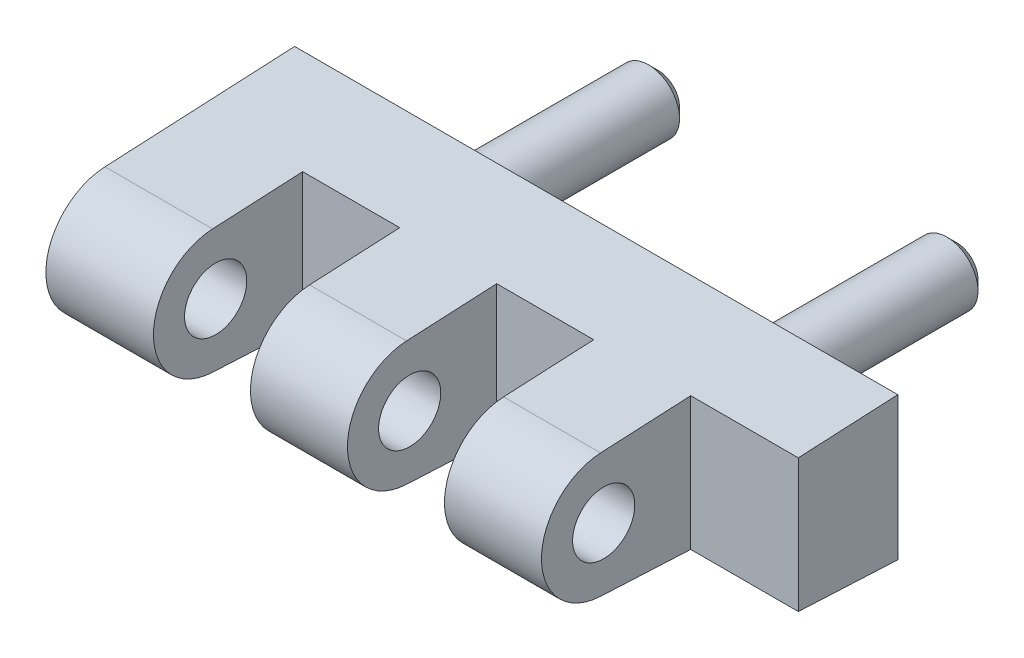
ISO-10303-21;
HEADER;
FILE_DESCRIPTION(('STEP AP214'),'2;1');
FILE_NAME('part.step','',(''),(''),'','','');
FILE_SCHEMA(('AUTOMOTIVE_DESIGN { 1 0 10303 214 1 1 1 1 }'));
ENDSEC;
DATA;
#1=APPLICATION_CONTEXT('core data for automotive mechanical design processes');
#2=APPLICATION_PROTOCOL_DEFINITION('international standard','automotive_design',2000,#1);
#3=PRODUCT_CONTEXT('',#1,'mechanical');
#4=PRODUCT('Part','Part','',(#3));
#5=PRODUCT_RELATED_PRODUCT_CATEGORY('part','',(#4));
#6=PRODUCT_DEFINITION_FORMATION('','',#4);
#7=PRODUCT_DEFINITION_CONTEXT('part definition',#1,'design');
#8=PRODUCT_DEFINITION('design','',#6,#7);
#9=PRODUCT_DEFINITION_SHAPE('','',#8);
#10=(LENGTH_UNIT() NAMED_UNIT(*) SI_UNIT(.MILLI.,.METRE.));
#11=(NAMED_UNIT(*) PLANE_ANGLE_UNIT() SI_UNIT($,.RADIAN.));
#12=(NAMED_UNIT(*) SI_UNIT($,.STERADIAN.) SOLID_ANGLE_UNIT());
#13=UNCERTAINTY_MEASURE_WITH_UNIT(LENGTH_MEASURE(1.E-05),#10,'distance_accuracy_value','');
#14=(GEOMETRIC_REPRESENTATION_CONTEXT(3) GLOBAL_UNCERTAINTY_ASSIGNED_CONTEXT((#13)) GLOBAL_UNIT_ASSIGNED_CONTEXT((#10,
#11,#12)) REPRESENTATION_CONTEXT('',''));
#15=CARTESIAN_POINT('',(0.,0.,0.));
#16=DIRECTION('',(0.,0.,1.));
#17=DIRECTION('',(1.,0.,0.));
#18=AXIS2_PLACEMENT_3D('',#15,#16,#17);
#19=CARTESIAN_POINT('',(36.25,0.,15.));
#20=DIRECTION('',(-1.,0.,0.));
#21=DIRECTION('',(0.,0.,1.));
#22=AXIS2_PLACEMENT_3D('',#19,#20,#21);
#23=CYLINDRICAL_SURFACE('',#22,5.);
#24=DIRECTION('',(-1.,0.,0.));
#25=VECTOR('',#24,1.);
#26=CARTESIAN_POINT('',(36.25,-4.99386330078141,15.2476475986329));
#27=LINE('',#26,#25);
#28=CARTESIAN_POINT('',(-3.6,-4.99386330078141,15.2476475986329));
#29=VERTEX_POINT('',#28);
#30=CARTESIAN_POINT('',(-12.25,-4.99386330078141,15.2476475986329));
#31=VERTEX_POINT('',#30);
#32=EDGE_CURVE('E162',#29,#31,#27,.T.);
#33=ORIENTED_EDGE('',*,*,#32,.F.);
#34=CARTESIAN_POINT('',(-3.6,0.,15.));
#35=DIRECTION('',(-1.,0.,0.));
#36=DIRECTION('',(0.,0.,1.));
#37=AXIS2_PLACEMENT_3D('',#34,#35,#36);
#38=CIRCLE('',#37,5.);
#39=CARTESIAN_POINT('',(-3.6,4.99386330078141,15.2476475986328));
#40=VERTEX_POINT('',#39);
#41=EDGE_CURVE('E205',#29,#40,#38,.T.);
#42=ORIENTED_EDGE('',*,*,#41,.T.);
#43=DIRECTION('',(-1.,0.,0.));
#44=VECTOR('',#43,1.);
#45=CARTESIAN_POINT('',(36.25,4.9938633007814,15.2476475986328));
#46=LINE('',#45,#44);
#47=CARTESIAN_POINT('',(-12.25,4.9938633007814,15.2476475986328));
#48=VERTEX_POINT('',#47);
#49=EDGE_CURVE('E175',#40,#48,#46,.T.);
#50=ORIENTED_EDGE('',*,*,#49,.T.);
#51=CARTESIAN_POINT('',(-12.25,0.,15.));
#52=DIRECTION('',(1.,0.,0.));
#53=DIRECTION('',(0.,0.,-1.));
#54=AXIS2_PLACEMENT_3D('',#51,#52,#53);
#55=CIRCLE('',#54,5.);
#56=EDGE_CURVE('E157',#48,#31,#55,.T.);
#57=ORIENTED_EDGE('',*,*,#56,.T.);
#58=EDGE_LOOP('',(#33,#42,#50,#57));
#59=FACE_BOUND('',#58,.T.);
#60=ADVANCED_FACE('F14',(#59),#23,.T.);
#61=CARTESIAN_POINT('',(12.,4.99386330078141,15.2476475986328));
#62=VERTEX_POINT('',#61);
#63=CARTESIAN_POINT('',(4.2,4.99386330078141,15.2476475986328));
#64=VERTEX_POINT('',#63);
#65=EDGE_CURVE('E177',#62,#64,#46,.T.);
#66=ORIENTED_EDGE('',*,*,#65,.T.);
#67=CARTESIAN_POINT('',(4.2,0.,15.));
#68=DIRECTION('',(1.,0.,0.));
#69=DIRECTION('',(0.,0.,-1.));
#70=AXIS2_PLACEMENT_3D('',#67,#68,#69);
#71=CIRCLE('',#70,5.);
#72=CARTESIAN_POINT('',(4.2,-4.99386330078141,15.2476475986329));
#73=VERTEX_POINT('',#72);
#74=EDGE_CURVE('E200',#64,#73,#71,.T.);
#75=ORIENTED_EDGE('',*,*,#74,.T.);
#76=CARTESIAN_POINT('',(12.,-4.99386330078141,15.2476475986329));
#77=VERTEX_POINT('',#76);
#78=EDGE_CURVE('E173',#77,#73,#27,.T.);
#79=ORIENTED_EDGE('',*,*,#78,.F.);
#80=CARTESIAN_POINT('',(12.,0.,15.));
#81=DIRECTION('',(-1.,0.,0.));
#82=DIRECTION('',(0.,0.,1.));
#83=AXIS2_PLACEMENT_3D('',#80,#81,#82);
#84=CIRCLE('',#83,5.);
#85=EDGE_CURVE('E195',#77,#62,#84,.T.);
#86=ORIENTED_EDGE('',*,*,#85,.T.);
#87=EDGE_LOOP('',(#66,#75,#79,#86));
#88=FACE_BOUND('',#87,.T.);
#89=ADVANCED_FACE('F234',(#88),#23,.T.);
#90=CARTESIAN_POINT('',(36.25,0.,15.));
#91=DIRECTION('',(-1.,0.,0.));
#92=DIRECTION('',(0.,0.,1.));
#93=AXIS2_PLACEMENT_3D('',#90,#91,#92);
#94=CYLINDRICAL_SURFACE('',#93,2.5);
#95=CARTESIAN_POINT('',(-3.6,0.,15.));
#96=DIRECTION('',(-1.,0.,0.));
#97=DIRECTION('',(0.,0.,1.));
#98=AXIS2_PLACEMENT_3D('',#95,#96,#97);
#99=CIRCLE('',#98,2.5);
#100=CARTESIAN_POINT('',(-3.6,0.,17.5));
#101=VERTEX_POINT('',#100);
#102=EDGE_CURVE('E202',#101,#101,#99,.T.);
#103=ORIENTED_EDGE('',*,*,#102,.F.);
#104=EDGE_LOOP('',(#103));
#105=FACE_BOUND('',#104,.T.);
#106=CARTESIAN_POINT('',(-12.25,0.,15.));
#107=DIRECTION('',(1.,0.,0.));
#108=DIRECTION('',(0.,0.,-1.));
#109=AXIS2_PLACEMENT_3D('',#106,#107,#108);
#110=CIRCLE('',#109,2.5);
#111=CARTESIAN_POINT('',(-12.25,0.,12.5));
#112=VERTEX_POINT('',#111);
#113=EDGE_CURVE('E150',#112,#112,#110,.T.);
#114=ORIENTED_EDGE('',*,*,#113,.F.);
#115=EDGE_LOOP('',(#114));
#116=FACE_BOUND('',#115,.T.);
#117=ADVANCED_FACE('F242',(#105,#116),#94,.F.);
#118=CARTESIAN_POINT('',(36.25,0.,15.));
#119=DIRECTION('',(1.,0.,0.));
#120=DIRECTION('',(0.,0.,-1.));
#121=AXIS2_PLACEMENT_3D('',#118,#119,#120);
#122=PLANE('',#121);
#123=DIRECTION('',(0.,1.,0.));
#124=VECTOR('',#123,1.);
#125=CARTESIAN_POINT('',(36.25,0.,8.));
#126=LINE('',#125,#124);
#127=CARTESIAN_POINT('',(36.25,-5.35327692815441,8.));
#128=VERTEX_POINT('',#127);
#129=CARTESIAN_POINT('',(36.25,5.3532769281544,8.));
#130=VERTEX_POINT('',#129);
#131=EDGE_CURVE('E140',#128,#130,#126,.T.);
#132=ORIENTED_EDGE('',*,*,#131,.F.);
#133=DIRECTION('',(0.,-0.0495295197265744,-0.998772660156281));
#134=VECTOR('',#133,1.);
#135=CARTESIAN_POINT('',(36.25,-5.75,0.));
#136=LINE('',#135,#134);
#137=CARTESIAN_POINT('',(36.25,-5.75,0.));
#138=VERTEX_POINT('',#137);
#139=EDGE_CURVE('E138',#128,#138,#136,.T.);
#140=ORIENTED_EDGE('',*,*,#139,.T.);
#141=DIRECTION('',(0.,1.,0.));
#142=VECTOR('',#141,1.);
#143=CARTESIAN_POINT('',(36.25,5.75,0.));
#144=LINE('',#143,#142);
#145=CARTESIAN_POINT('',(36.25,5.75,0.));
#146=VERTEX_POINT('',#145);
#147=EDGE_CURVE('E156',#138,#146,#144,.T.);
#148=ORIENTED_EDGE('',*,*,#147,.T.);
#149=DIRECTION('',(0.,-0.0495295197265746,0.998772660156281));
#150=VECTOR('',#149,1.);
#151=CARTESIAN_POINT('',(36.25,5.75,0.));
#152=LINE('',#151,#150);
#153=EDGE_CURVE('E159',#146,#130,#152,.T.);
#154=ORIENTED_EDGE('',*,*,#153,.T.);
#155=EDGE_LOOP('',(#132,#140,#148,#154));
#156=FACE_BOUND('',#155,.T.);
#157=ADVANCED_FACE('F342',(#156),#122,.T.);
#158=CARTESIAN_POINT('',(-12.25,0.,15.));
#159=DIRECTION('',(1.,0.,0.));
#160=DIRECTION('',(0.,0.,-1.));
#161=AXIS2_PLACEMENT_3D('',#158,#159,#160);
#162=PLANE('',#161);
#163=DIRECTION('',(0.,-0.0495295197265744,-0.998772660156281));
#164=VECTOR('',#163,1.);
#165=CARTESIAN_POINT('',(-12.25,-5.75,0.));
#166=LINE('',#165,#164);
#167=CARTESIAN_POINT('',(-12.25,-5.75,0.));
#168=VERTEX_POINT('',#167);
#169=EDGE_CURVE('E154',#31,#168,#166,.T.);
#170=ORIENTED_EDGE('',*,*,#169,.F.);
#171=ORIENTED_EDGE('',*,*,#56,.F.);
#172=DIRECTION('',(0.,-0.0495295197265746,0.998772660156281));
#173=VECTOR('',#172,1.);
#174=CARTESIAN_POINT('',(-12.25,5.75,0.));
#175=LINE('',#174,#173);
#176=CARTESIAN_POINT('',(-12.25,5.75,0.));
#177=VERTEX_POINT('',#176);
#178=EDGE_CURVE('E167',#177,#48,#175,.T.);
#179=ORIENTED_EDGE('',*,*,#178,.F.);
#180=DIRECTION('',(0.,1.,0.));
#181=VECTOR('',#180,1.);
#182=CARTESIAN_POINT('',(-12.25,5.75,0.));
#183=LINE('',#182,#181);
#184=EDGE_CURVE('E165',#168,#177,#183,.T.);
#185=ORIENTED_EDGE('',*,*,#184,.F.);
#186=EDGE_LOOP('',(#170,#171,#179,#185));
#187=FACE_BOUND('',#186,.T.);
#188=ORIENTED_EDGE('',*,*,#113,.T.);
#189=EDGE_LOOP('',(#188));
#190=FACE_BOUND('',#189,.T.);
#191=ADVANCED_FACE('F344',(#187,#190),#162,.F.);
#192=CARTESIAN_POINT('',(36.25,-5.75,0.));
#193=DIRECTION('',(0.,0.998772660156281,-0.0495295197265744));
#194=DIRECTION('',(0.,0.0495295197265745,0.998772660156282));
#195=AXIS2_PLACEMENT_3D('',#192,#193,#194);
#196=PLANE('',#195);
#197=DIRECTION('',(-1.,0.,0.));
#198=VECTOR('',#197,1.);
#199=CARTESIAN_POINT('',(36.25,-5.35327692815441,8.));
#200=LINE('',#199,#198);
#201=CARTESIAN_POINT('',(4.2,-5.35327692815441,8.));
#202=VERTEX_POINT('',#201);
#203=CARTESIAN_POINT('',(-3.6,-5.35327692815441,8.));
#204=VERTEX_POINT('',#203);
#205=EDGE_CURVE('E145',#202,#204,#200,.T.);
#206=ORIENTED_EDGE('',*,*,#205,.T.);
#207=DIRECTION('',(0.,0.0495295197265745,0.998772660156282));
#208=VECTOR('',#207,1.);
#209=CARTESIAN_POINT('',(-3.6,-5.75,0.));
#210=LINE('',#209,#208);
#211=EDGE_CURVE('E284',#204,#29,#210,.T.);
#212=ORIENTED_EDGE('',*,*,#211,.T.);
#213=ORIENTED_EDGE('',*,*,#32,.T.);
#214=ORIENTED_EDGE('',*,*,#169,.T.);
#215=DIRECTION('',(-1.,0.,0.));
#216=VECTOR('',#215,1.);
#217=CARTESIAN_POINT('',(36.25,-5.75,0.));
#218=LINE('',#217,#216);
#219=EDGE_CURVE('E182',#138,#168,#218,.T.);
#220=ORIENTED_EDGE('',*,*,#219,.F.);
#221=ORIENTED_EDGE('',*,*,#139,.F.);
#222=DIRECTION('',(-1.,0.,0.));
#223=VECTOR('',#222,1.);
#224=CARTESIAN_POINT('',(36.25,-5.35327692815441,8.));
#225=LINE('',#224,#223);
#226=CARTESIAN_POINT('',(27.6,-5.35327692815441,8.));
#227=VERTEX_POINT('',#226);
#228=EDGE_CURVE('E128',#128,#227,#225,.T.);
#229=ORIENTED_EDGE('',*,*,#228,.T.);
#230=DIRECTION('',(0.,0.0495295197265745,0.998772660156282));
#231=VECTOR('',#230,1.);
#232=CARTESIAN_POINT('',(27.6,-5.75,0.));
#233=LINE('',#232,#231);
#234=CARTESIAN_POINT('',(27.6,-4.99386330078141,15.2476475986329));
#235=VERTEX_POINT('',#234);
#236=EDGE_CURVE('E115',#227,#235,#233,.T.);
#237=ORIENTED_EDGE('',*,*,#236,.T.);
#238=CARTESIAN_POINT('',(19.8,-4.99386330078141,15.2476475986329));
#239=VERTEX_POINT('',#238);
#240=EDGE_CURVE('E174',#235,#239,#27,.T.);
#241=ORIENTED_EDGE('',*,*,#240,.T.);
#242=DIRECTION('',(0.,-0.0495295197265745,-0.998772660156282));
#243=VECTOR('',#242,1.);
#244=CARTESIAN_POINT('',(19.8,-5.75,0.));
#245=LINE('',#244,#243);
#246=CARTESIAN_POINT('',(19.8,-5.35327692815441,8.));
#247=VERTEX_POINT('',#246);
#248=EDGE_CURVE('E196',#239,#247,#245,.T.);
#249=ORIENTED_EDGE('',*,*,#248,.T.);
#250=DIRECTION('',(-1.,0.,0.));
#251=VECTOR('',#250,1.);
#252=CARTESIAN_POINT('',(36.25,-5.35327692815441,8.));
#253=LINE('',#252,#251);
#254=CARTESIAN_POINT('',(12.,-5.35327692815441,8.));
#255=VERTEX_POINT('',#254);
#256=EDGE_CURVE('E287',#247,#255,#253,.T.);
#257=ORIENTED_EDGE('',*,*,#256,.T.);
#258=DIRECTION('',(0.,0.0495295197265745,0.998772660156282));
#259=VECTOR('',#258,1.);
#260=CARTESIAN_POINT('',(12.,-5.75,0.));
#261=LINE('',#260,#259);
#262=EDGE_CURVE('E201',#255,#77,#261,.T.);
#263=ORIENTED_EDGE('',*,*,#262,.T.);
#264=ORIENTED_EDGE('',*,*,#78,.T.);
#265=DIRECTION('',(0.,-0.0495295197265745,-0.998772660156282));
#266=VECTOR('',#265,1.);
#267=CARTESIAN_POINT('',(4.2,-5.75,0.));
#268=LINE('',#267,#266);
#269=EDGE_CURVE('E37',#73,#202,#268,.T.);
#270=ORIENTED_EDGE('',*,*,#269,.T.);
#271=EDGE_LOOP('',(#206,#212,#213,#214,#220,#221,#229,#237,#241,#249,#257,#263,#264,#270));
#272=FACE_BOUND('',#271,.T.);
#273=ADVANCED_FACE('F136',(#272),#196,.F.);
#274=CARTESIAN_POINT('',(36.25,5.75,0.));
#275=DIRECTION('',(0.,0.,1.));
#276=DIRECTION('',(0.,-1.,0.));
#277=AXIS2_PLACEMENT_3D('',#274,#275,#276);
#278=PLANE('',#277);
#279=CARTESIAN_POINT('',(0.,0.,0.));
#280=DIRECTION('',(0.,0.,-1.));
#281=DIRECTION('',(0.,1.,0.));
#282=AXIS2_PLACEMENT_3D('',#279,#280,#281);
#283=CIRCLE('',#282,2.5);
#284=CARTESIAN_POINT('',(0.,2.5,0.));
#285=VERTEX_POINT('',#284);
#286=EDGE_CURVE('E143',#285,#285,#283,.T.);
#287=ORIENTED_EDGE('',*,*,#286,.F.);
#288=EDGE_LOOP('',(#287));
#289=FACE_BOUND('',#288,.T.);
#290=CARTESIAN_POINT('',(24.,0.,0.));
#291=DIRECTION('',(0.,0.,-1.));
#292=DIRECTION('',(0.,1.,0.));
#293=AXIS2_PLACEMENT_3D('',#290,#291,#292);
#294=CIRCLE('',#293,2.5);
#295=CARTESIAN_POINT('',(24.,2.5,0.));
#296=VERTEX_POINT('',#295);
#297=EDGE_CURVE('E139',#296,#296,#294,.T.);
#298=ORIENTED_EDGE('',*,*,#297,.F.);
#299=EDGE_LOOP('',(#298));
#300=FACE_BOUND('',#299,.T.);
#301=ORIENTED_EDGE('',*,*,#184,.T.);
#302=DIRECTION('',(-1.,0.,0.));
#303=VECTOR('',#302,1.);
#304=CARTESIAN_POINT('',(36.25,5.75,0.));
#305=LINE('',#304,#303);
#306=EDGE_CURVE('E179',#146,#177,#305,.T.);
#307=ORIENTED_EDGE('',*,*,#306,.F.);
#308=ORIENTED_EDGE('',*,*,#147,.F.);
#309=ORIENTED_EDGE('',*,*,#219,.T.);
#310=EDGE_LOOP('',(#301,#307,#308,#309));
#311=FACE_BOUND('',#310,.T.);
#312=ADVANCED_FACE('F257',(#289,#300,#311),#278,.F.);
#313=CARTESIAN_POINT('',(36.25,5.75,0.));
#314=DIRECTION('',(0.,-0.998772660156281,-0.0495295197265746));
#315=DIRECTION('',(0.,0.0495295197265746,-0.998772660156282));
#316=AXIS2_PLACEMENT_3D('',#313,#314,#315);
#317=PLANE('',#316);
#318=ORIENTED_EDGE('',*,*,#49,.F.);
#319=DIRECTION('',(0.,0.0495295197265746,-0.998772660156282));
#320=VECTOR('',#319,1.);
#321=CARTESIAN_POINT('',(-3.6,5.75,0.));
#322=LINE('',#321,#320);
#323=CARTESIAN_POINT('',(-3.6,5.3532769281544,8.));
#324=VERTEX_POINT('',#323);
#325=EDGE_CURVE('E282',#40,#324,#322,.T.);
#326=ORIENTED_EDGE('',*,*,#325,.T.);
#327=DIRECTION('',(1.,0.,0.));
#328=VECTOR('',#327,1.);
#329=CARTESIAN_POINT('',(36.25,5.3532769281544,8.));
#330=LINE('',#329,#328);
#331=CARTESIAN_POINT('',(4.2,5.3532769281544,8.));
#332=VERTEX_POINT('',#331);
#333=EDGE_CURVE('E210',#324,#332,#330,.T.);
#334=ORIENTED_EDGE('',*,*,#333,.T.);
#335=DIRECTION('',(0.,-0.0495295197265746,0.998772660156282));
#336=VECTOR('',#335,1.);
#337=CARTESIAN_POINT('',(4.2,5.75,0.));
#338=LINE('',#337,#336);
#339=EDGE_CURVE('E272',#332,#64,#338,.T.);
#340=ORIENTED_EDGE('',*,*,#339,.T.);
#341=ORIENTED_EDGE('',*,*,#65,.F.);
#342=DIRECTION('',(0.,0.0495295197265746,-0.998772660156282));
#343=VECTOR('',#342,1.);
#344=CARTESIAN_POINT('',(12.,5.75,0.));
#345=LINE('',#344,#343);
#346=CARTESIAN_POINT('',(12.,5.3532769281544,8.));
#347=VERTEX_POINT('',#346);
#348=EDGE_CURVE('E271',#62,#347,#345,.T.);
#349=ORIENTED_EDGE('',*,*,#348,.T.);
#350=DIRECTION('',(1.,0.,0.));
#351=VECTOR('',#350,1.);
#352=CARTESIAN_POINT('',(36.25,5.3532769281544,8.));
#353=LINE('',#352,#351);
#354=CARTESIAN_POINT('',(19.8,5.3532769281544,8.));
#355=VERTEX_POINT('',#354);
#356=EDGE_CURVE('E207',#347,#355,#353,.T.);
#357=ORIENTED_EDGE('',*,*,#356,.T.);
#358=DIRECTION('',(0.,-0.0495295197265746,0.998772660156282));
#359=VECTOR('',#358,1.);
#360=CARTESIAN_POINT('',(19.8,5.75,0.));
#361=LINE('',#360,#359);
#362=CARTESIAN_POINT('',(19.8,4.99386330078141,15.2476475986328));
#363=VERTEX_POINT('',#362);
#364=EDGE_CURVE('E306',#355,#363,#361,.T.);
#365=ORIENTED_EDGE('',*,*,#364,.T.);
#366=CARTESIAN_POINT('',(27.6,4.9938633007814,15.2476475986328));
#367=VERTEX_POINT('',#366);
#368=EDGE_CURVE('E178',#367,#363,#46,.T.);
#369=ORIENTED_EDGE('',*,*,#368,.F.);
#370=DIRECTION('',(0.,0.0495295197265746,-0.998772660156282));
#371=VECTOR('',#370,1.);
#372=CARTESIAN_POINT('',(27.6,5.75,0.));
#373=LINE('',#372,#371);
#374=CARTESIAN_POINT('',(27.6,5.3532769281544,8.));
#375=VERTEX_POINT('',#374);
#376=EDGE_CURVE('E29',#367,#375,#373,.T.);
#377=ORIENTED_EDGE('',*,*,#376,.T.);
#378=DIRECTION('',(1.,0.,0.));
#379=VECTOR('',#378,1.);
#380=CARTESIAN_POINT('',(36.25,5.3532769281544,8.));
#381=LINE('',#380,#379);
#382=EDGE_CURVE('E131',#375,#130,#381,.T.);
#383=ORIENTED_EDGE('',*,*,#382,.T.);
#384=ORIENTED_EDGE('',*,*,#153,.F.);
#385=ORIENTED_EDGE('',*,*,#306,.T.);
#386=ORIENTED_EDGE('',*,*,#178,.T.);
#387=EDGE_LOOP('',(#318,#326,#334,#340,#341,#349,#357,#365,#369,#377,#383,#384,#385,#386));
#388=FACE_BOUND('',#387,.T.);
#389=ADVANCED_FACE('F248',(#388),#317,.F.);
#390=ORIENTED_EDGE('',*,*,#368,.T.);
#391=CARTESIAN_POINT('',(19.8,0.,15.));
#392=DIRECTION('',(1.,0.,0.));
#393=DIRECTION('',(0.,0.,-1.));
#394=AXIS2_PLACEMENT_3D('',#391,#392,#393);
#395=CIRCLE('',#394,5.);
#396=EDGE_CURVE('E191',#363,#239,#395,.T.);
#397=ORIENTED_EDGE('',*,*,#396,.T.);
#398=ORIENTED_EDGE('',*,*,#240,.F.);
#399=CARTESIAN_POINT('',(27.6,0.,15.));
#400=DIRECTION('',(-1.,0.,0.));
#401=DIRECTION('',(0.,0.,1.));
#402=AXIS2_PLACEMENT_3D('',#399,#400,#401);
#403=CIRCLE('',#402,5.);
#404=EDGE_CURVE('E119',#235,#367,#403,.T.);
#405=ORIENTED_EDGE('',*,*,#404,.T.);
#406=EDGE_LOOP('',(#390,#397,#398,#405));
#407=FACE_BOUND('',#406,.T.);
#408=ADVANCED_FACE('F237',(#407),#23,.T.);
#409=CARTESIAN_POINT('',(27.6,-8.25,26.1790008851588));
#410=DIRECTION('',(-1.,0.,0.));
#411=DIRECTION('',(0.,0.,1.));
#412=AXIS2_PLACEMENT_3D('',#409,#410,#411);
#413=PLANE('',#412);
#414=CARTESIAN_POINT('',(27.6,0.,15.));
#415=DIRECTION('',(-1.,0.,0.));
#416=DIRECTION('',(0.,0.,1.));
#417=AXIS2_PLACEMENT_3D('',#414,#415,#416);
#418=CIRCLE('',#417,2.5);
#419=CARTESIAN_POINT('',(27.6,0.,17.5));
#420=VERTEX_POINT('',#419);
#421=EDGE_CURVE('E185',#420,#420,#418,.T.);
#422=ORIENTED_EDGE('',*,*,#421,.T.);
#423=EDGE_LOOP('',(#422));
#424=FACE_BOUND('',#423,.T.);
#425=DIRECTION('',(0.,1.,0.));
#426=VECTOR('',#425,1.);
#427=CARTESIAN_POINT('',(27.6,-8.25,8.));
#428=LINE('',#427,#426);
#429=EDGE_CURVE('E118',#227,#375,#428,.T.);
#430=ORIENTED_EDGE('',*,*,#429,.T.);
#431=ORIENTED_EDGE('',*,*,#376,.F.);
#432=ORIENTED_EDGE('',*,*,#404,.F.);
#433=ORIENTED_EDGE('',*,*,#236,.F.);
#434=EDGE_LOOP('',(#430,#431,#432,#433));
#435=FACE_BOUND('',#434,.T.);
#436=ADVANCED_FACE('F117',(#424,#435),#413,.F.);
#437=CARTESIAN_POINT('',(27.6,-8.25,8.));
#438=DIRECTION('',(0.,0.,-1.));
#439=DIRECTION('',(-1.,0.,0.));
#440=AXIS2_PLACEMENT_3D('',#437,#438,#439);
#441=PLANE('',#440);
#442=ORIENTED_EDGE('',*,*,#131,.T.);
#443=ORIENTED_EDGE('',*,*,#382,.F.);
#444=ORIENTED_EDGE('',*,*,#429,.F.);
#445=ORIENTED_EDGE('',*,*,#228,.F.);
#446=EDGE_LOOP('',(#442,#443,#444,#445));
#447=FACE_BOUND('',#446,.T.);
#448=ADVANCED_FACE('F127',(#447),#441,.F.);
#449=CARTESIAN_POINT('',(12.,-8.25,8.));
#450=DIRECTION('',(-1.,0.,0.));
#451=DIRECTION('',(0.,0.,1.));
#452=AXIS2_PLACEMENT_3D('',#449,#450,#451);
#453=PLANE('',#452);
#454=CARTESIAN_POINT('',(12.,0.,15.));
#455=DIRECTION('',(-1.,0.,0.));
#456=DIRECTION('',(0.,0.,1.));
#457=AXIS2_PLACEMENT_3D('',#454,#455,#456);
#458=CIRCLE('',#457,2.5);
#459=CARTESIAN_POINT('',(12.,0.,17.5));
#460=VERTEX_POINT('',#459);
#461=EDGE_CURVE('E192',#460,#460,#458,.T.);
#462=ORIENTED_EDGE('',*,*,#461,.T.);
#463=EDGE_LOOP('',(#462));
#464=FACE_BOUND('',#463,.T.);
#465=DIRECTION('',(0.,1.,0.));
#466=VECTOR('',#465,1.);
#467=CARTESIAN_POINT('',(12.,-8.25,8.));
#468=LINE('',#467,#466);
#469=EDGE_CURVE('E295',#255,#347,#468,.T.);
#470=ORIENTED_EDGE('',*,*,#469,.T.);
#471=ORIENTED_EDGE('',*,*,#348,.F.);
#472=ORIENTED_EDGE('',*,*,#85,.F.);
#473=ORIENTED_EDGE('',*,*,#262,.F.);
#474=EDGE_LOOP('',(#470,#471,#472,#473));
#475=FACE_BOUND('',#474,.T.);
#476=ADVANCED_FACE('F319',(#464,#475),#453,.F.);
#477=CARTESIAN_POINT('',(19.8,-8.25,8.));
#478=DIRECTION('',(1.,0.,0.));
#479=DIRECTION('',(0.,0.,-1.));
#480=AXIS2_PLACEMENT_3D('',#477,#478,#479);
#481=PLANE('',#480);
#482=CARTESIAN_POINT('',(19.8,0.,15.));
#483=DIRECTION('',(1.,0.,0.));
#484=DIRECTION('',(0.,0.,-1.));
#485=AXIS2_PLACEMENT_3D('',#482,#483,#484);
#486=CIRCLE('',#485,2.5);
#487=CARTESIAN_POINT('',(19.8,0.,12.5));
#488=VERTEX_POINT('',#487);
#489=EDGE_CURVE('E124',#488,#488,#486,.T.);
#490=ORIENTED_EDGE('',*,*,#489,.T.);
#491=EDGE_LOOP('',(#490));
#492=FACE_BOUND('',#491,.T.);
#493=ORIENTED_EDGE('',*,*,#396,.F.);
#494=ORIENTED_EDGE('',*,*,#364,.F.);
#495=DIRECTION('',(0.,1.,0.));
#496=VECTOR('',#495,1.);
#497=CARTESIAN_POINT('',(19.8,-8.25,8.));
#498=LINE('',#497,#496);
#499=EDGE_CURVE('E132',#247,#355,#498,.T.);
#500=ORIENTED_EDGE('',*,*,#499,.F.);
#501=ORIENTED_EDGE('',*,*,#248,.F.);
#502=EDGE_LOOP('',(#493,#494,#500,#501));
#503=FACE_BOUND('',#502,.T.);
#504=ADVANCED_FACE('F316',(#492,#503),#481,.F.);
#505=CARTESIAN_POINT('',(12.,-8.25,8.));
#506=DIRECTION('',(0.,0.,-1.));
#507=DIRECTION('',(-1.,0.,0.));
#508=AXIS2_PLACEMENT_3D('',#505,#506,#507);
#509=PLANE('',#508);
#510=ORIENTED_EDGE('',*,*,#499,.T.);
#511=ORIENTED_EDGE('',*,*,#356,.F.);
#512=ORIENTED_EDGE('',*,*,#469,.F.);
#513=ORIENTED_EDGE('',*,*,#256,.F.);
#514=EDGE_LOOP('',(#510,#511,#512,#513));
#515=FACE_BOUND('',#514,.T.);
#516=ADVANCED_FACE('F318',(#515),#509,.F.);
#517=CARTESIAN_POINT('',(4.2,0.,15.));
#518=DIRECTION('',(1.,0.,0.));
#519=DIRECTION('',(0.,0.,-1.));
#520=AXIS2_PLACEMENT_3D('',#517,#518,#519);
#521=CIRCLE('',#520,2.5);
#522=CARTESIAN_POINT('',(4.2,0.,12.5));
#523=VERTEX_POINT('',#522);
#524=EDGE_CURVE('E197',#523,#523,#521,.T.);
#525=ORIENTED_EDGE('',*,*,#524,.F.);
#526=EDGE_LOOP('',(#525));
#527=FACE_BOUND('',#526,.T.);
#528=ORIENTED_EDGE('',*,*,#461,.F.);
#529=EDGE_LOOP('',(#528));
#530=FACE_BOUND('',#529,.T.);
#531=ADVANCED_FACE('F335',(#527,#530),#94,.F.);
#532=CARTESIAN_POINT('',(-3.6,-8.25,8.));
#533=DIRECTION('',(0.,0.,-1.));
#534=DIRECTION('',(-1.,0.,0.));
#535=AXIS2_PLACEMENT_3D('',#532,#533,#534);
#536=PLANE('',#535);
#537=DIRECTION('',(0.,1.,0.));
#538=VECTOR('',#537,1.);
#539=CARTESIAN_POINT('',(4.2,-8.25,8.));
#540=LINE('',#539,#538);
#541=EDGE_CURVE('E292',#202,#332,#540,.T.);
#542=ORIENTED_EDGE('',*,*,#541,.T.);
#543=ORIENTED_EDGE('',*,*,#333,.F.);
#544=DIRECTION('',(0.,1.,0.));
#545=VECTOR('',#544,1.);
#546=CARTESIAN_POINT('',(-3.6,-8.25,8.));
#547=LINE('',#546,#545);
#548=EDGE_CURVE('E188',#204,#324,#547,.T.);
#549=ORIENTED_EDGE('',*,*,#548,.F.);
#550=ORIENTED_EDGE('',*,*,#205,.F.);
#551=EDGE_LOOP('',(#542,#543,#549,#550));
#552=FACE_BOUND('',#551,.T.);
#553=ADVANCED_FACE('F291',(#552),#536,.F.);
#554=CARTESIAN_POINT('',(-3.6,-8.25,30.3209215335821));
#555=DIRECTION('',(-1.,0.,0.));
#556=DIRECTION('',(0.,0.,1.));
#557=AXIS2_PLACEMENT_3D('',#554,#555,#556);
#558=PLANE('',#557);
#559=ORIENTED_EDGE('',*,*,#102,.T.);
#560=EDGE_LOOP('',(#559));
#561=FACE_BOUND('',#560,.T.);
#562=ORIENTED_EDGE('',*,*,#548,.T.);
#563=ORIENTED_EDGE('',*,*,#325,.F.);
#564=ORIENTED_EDGE('',*,*,#41,.F.);
#565=ORIENTED_EDGE('',*,*,#211,.F.);
#566=EDGE_LOOP('',(#562,#563,#564,#565));
#567=FACE_BOUND('',#566,.T.);
#568=ADVANCED_FACE('F370',(#561,#567),#558,.F.);
#569=CARTESIAN_POINT('',(4.2,-8.25,26.1790008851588));
#570=DIRECTION('',(1.,0.,0.));
#571=DIRECTION('',(0.,0.,-1.));
#572=AXIS2_PLACEMENT_3D('',#569,#570,#571);
#573=PLANE('',#572);
#574=ORIENTED_EDGE('',*,*,#524,.T.);
#575=EDGE_LOOP('',(#574));
#576=FACE_BOUND('',#575,.T.);
#577=ORIENTED_EDGE('',*,*,#74,.F.);
#578=ORIENTED_EDGE('',*,*,#339,.F.);
#579=ORIENTED_EDGE('',*,*,#541,.F.);
#580=ORIENTED_EDGE('',*,*,#269,.F.);
#581=EDGE_LOOP('',(#577,#578,#579,#580));
#582=FACE_BOUND('',#581,.T.);
#583=ADVANCED_FACE('F294',(#576,#582),#573,.F.);
#584=ORIENTED_EDGE('',*,*,#489,.F.);
#585=EDGE_LOOP('',(#584));
#586=FACE_BOUND('',#585,.T.);
#587=ORIENTED_EDGE('',*,*,#421,.F.);
#588=EDGE_LOOP('',(#587));
#589=FACE_BOUND('',#588,.T.);
#590=ADVANCED_FACE('F337',(#586,#589),#94,.F.);
#591=CARTESIAN_POINT('',(24.,0.,-17.));
#592=DIRECTION('',(0.,0.,1.));
#593=DIRECTION('',(0.,-1.,0.));
#594=AXIS2_PLACEMENT_3D('',#591,#592,#593);
#595=CYLINDRICAL_SURFACE('',#594,2.5);
#596=CARTESIAN_POINT('',(24.,0.,-16.2));
#597=DIRECTION('',(0.,0.,-1.));
#598=DIRECTION('',(0.,1.,0.));
#599=AXIS2_PLACEMENT_3D('',#596,#597,#598);
#600=CIRCLE('',#599,2.5);
#601=CARTESIAN_POINT('',(24.,2.5,-16.2));
#602=VERTEX_POINT('',#601);
#603=EDGE_CURVE('E216',#602,#602,#600,.F.);
#604=ORIENTED_EDGE('',*,*,#603,.T.);
#605=EDGE_LOOP('',(#604));
#606=FACE_BOUND('',#605,.T.);
#607=ORIENTED_EDGE('',*,*,#297,.T.);
#608=EDGE_LOOP('',(#607));
#609=FACE_BOUND('',#608,.T.);
#610=ADVANCED_FACE('F340',(#606,#609),#595,.T.);
#611=CARTESIAN_POINT('',(24.,0.,-17.));
#612=DIRECTION('',(0.,0.,-1.));
#613=DIRECTION('',(0.,1.,0.));
#614=AXIS2_PLACEMENT_3D('',#611,#612,#613);
#615=PLANE('',#614);
#616=CARTESIAN_POINT('',(24.,0.,-17.));
#617=DIRECTION('',(0.,0.,-1.));
#618=DIRECTION('',(0.,1.,0.));
#619=AXIS2_PLACEMENT_3D('',#616,#617,#618);
#620=CIRCLE('',#619,1.7);
#621=CARTESIAN_POINT('',(24.,1.7,-17.));
#622=VERTEX_POINT('',#621);
#623=EDGE_CURVE('E213',#622,#622,#620,.T.);
#624=ORIENTED_EDGE('',*,*,#623,.T.);
#625=EDGE_LOOP('',(#624));
#626=FACE_BOUND('',#625,.T.);
#627=ADVANCED_FACE('F389',(#626),#615,.T.);
#628=CARTESIAN_POINT('',(0.,0.,-17.));
#629=DIRECTION('',(0.,0.,1.));
#630=DIRECTION('',(0.,-1.,0.));
#631=AXIS2_PLACEMENT_3D('',#628,#629,#630);
#632=CYLINDRICAL_SURFACE('',#631,2.5);
#633=CARTESIAN_POINT('',(0.,0.,-16.2));
#634=DIRECTION('',(0.,0.,-1.));
#635=DIRECTION('',(0.,1.,0.));
#636=AXIS2_PLACEMENT_3D('',#633,#634,#635);
#637=CIRCLE('',#636,2.5);
#638=CARTESIAN_POINT('',(0.,2.5,-16.2));
#639=VERTEX_POINT('',#638);
#640=EDGE_CURVE('E9',#639,#639,#637,.F.);
#641=ORIENTED_EDGE('',*,*,#640,.T.);
#642=EDGE_LOOP('',(#641));
#643=FACE_BOUND('',#642,.T.);
#644=ORIENTED_EDGE('',*,*,#286,.T.);
#645=EDGE_LOOP('',(#644));
#646=FACE_BOUND('',#645,.T.);
#647=ADVANCED_FACE('F393',(#643,#646),#632,.T.);
#648=CARTESIAN_POINT('',(0.,0.,-17.));
#649=DIRECTION('',(0.,0.,-1.));
#650=DIRECTION('',(0.,1.,0.));
#651=AXIS2_PLACEMENT_3D('',#648,#649,#650);
#652=PLANE('',#651);
#653=CARTESIAN_POINT('',(0.,0.,-17.));
#654=DIRECTION('',(0.,0.,-1.));
#655=DIRECTION('',(0.,1.,0.));
#656=AXIS2_PLACEMENT_3D('',#653,#654,#655);
#657=CIRCLE('',#656,1.7);
#658=CARTESIAN_POINT('',(0.,1.7,-17.));
#659=VERTEX_POINT('',#658);
#660=EDGE_CURVE('E22',#659,#659,#657,.T.);
#661=ORIENTED_EDGE('',*,*,#660,.T.);
#662=EDGE_LOOP('',(#661));
#663=FACE_BOUND('',#662,.T.);
#664=ADVANCED_FACE('F221',(#663),#652,.T.);
#665=CARTESIAN_POINT('',(24.,0.,-17.));
#666=DIRECTION('',(0.,0.,1.));
#667=DIRECTION('',(0.,-1.,0.));
#668=AXIS2_PLACEMENT_3D('',#665,#666,#667);
#669=CONICAL_SURFACE('',#668,1.7,0.785398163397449);
#670=ORIENTED_EDGE('',*,*,#603,.F.);
#671=EDGE_LOOP('',(#670));
#672=FACE_BOUND('',#671,.T.);
#673=ORIENTED_EDGE('',*,*,#623,.F.);
#674=EDGE_LOOP('',(#673));
#675=FACE_BOUND('',#674,.T.);
#676=ADVANCED_FACE('F224',(#672,#675),#669,.T.);
#677=CARTESIAN_POINT('',(0.,0.,-17.));
#678=DIRECTION('',(0.,0.,1.));
#679=DIRECTION('',(0.,-1.,0.));
#680=AXIS2_PLACEMENT_3D('',#677,#678,#679);
#681=CONICAL_SURFACE('',#680,1.7,0.785398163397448);
#682=ORIENTED_EDGE('',*,*,#640,.F.);
#683=EDGE_LOOP('',(#682));
#684=FACE_BOUND('',#683,.T.);
#685=ORIENTED_EDGE('',*,*,#660,.F.);
#686=EDGE_LOOP('',(#685));
#687=FACE_BOUND('',#686,.T.);
#688=ADVANCED_FACE('F16',(#684,#687),#681,.T.);
#689=CLOSED_SHELL('',(#60,#89,#117,#157,#191,#273,#312,#389,#408,#436,#448,#476,#504,#516,#531,
#553,#568,#583,#590,#610,#627,#647,#664,#676,#688));
#690=MANIFOLD_SOLID_BREP('B1',#689);
#691=ADVANCED_BREP_SHAPE_REPRESENTATION('',(#18,#690),#14);
#692=SHAPE_DEFINITION_REPRESENTATION(#9,#691);
ENDSEC;
END-ISO-10303-21;
